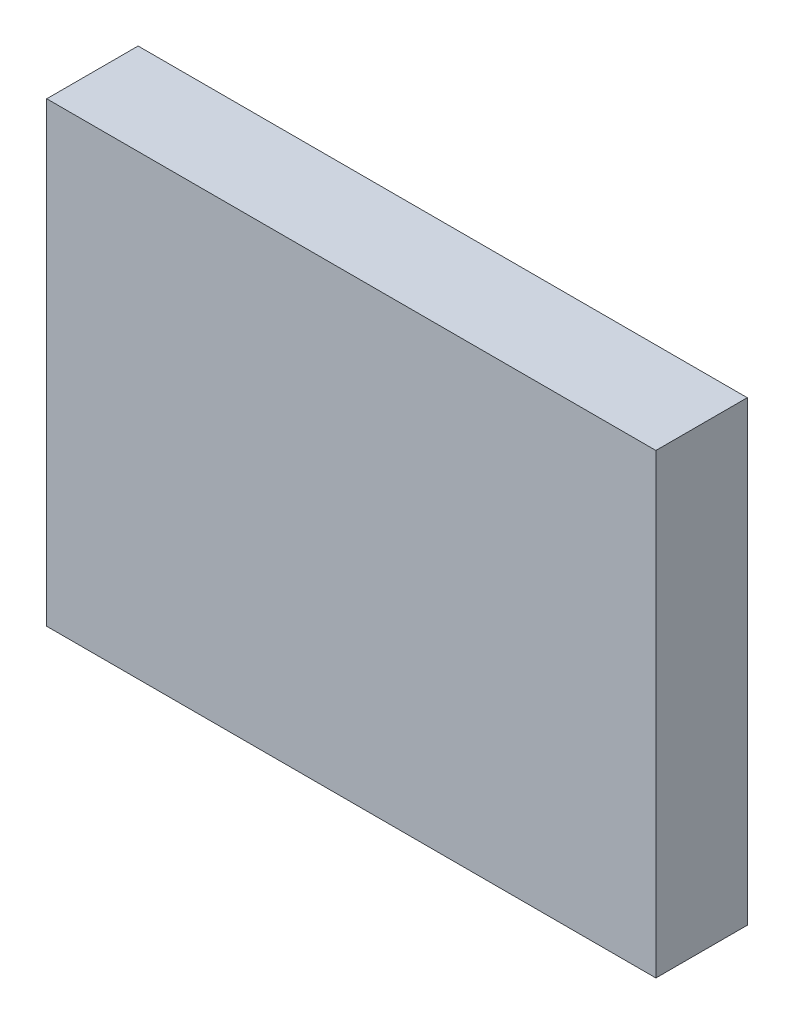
from build123d import *

# Parameters (mm, degrees)
SKETCH_1_W      = 40
SKETCH_1_H      = 30
EXTRUDE_1_DEPTH = 6


with BuildPart() as part:
    # Sketch 1 → Extrude 1 (new body)
    with BuildSketch(Plane.XY):
        with Locations((20, 15)):
            Rectangle(SKETCH_1_W, SKETCH_1_H)
    extrude(amount=EXTRUDE_1_DEPTH)


solid = part.part
